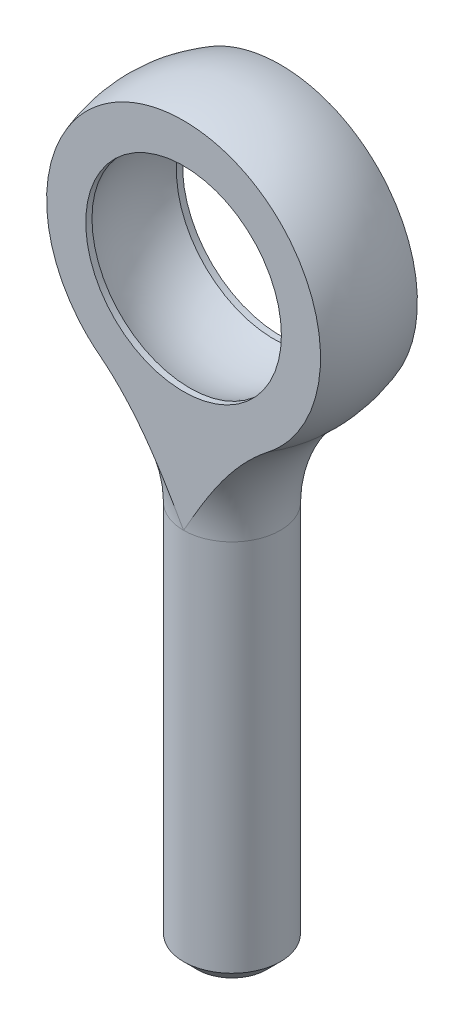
ISO-10303-21;
HEADER;
FILE_DESCRIPTION(('STEP AP214'),'2;1');
FILE_NAME('part.step','',(''),(''),'','','');
FILE_SCHEMA(('AUTOMOTIVE_DESIGN { 1 0 10303 214 1 1 1 1 }'));
ENDSEC;
DATA;
#1=APPLICATION_CONTEXT('core data for automotive mechanical design processes');
#2=APPLICATION_PROTOCOL_DEFINITION('international standard','automotive_design',2000,#1);
#3=PRODUCT_CONTEXT('',#1,'mechanical');
#4=PRODUCT('Part','Part','',(#3));
#5=PRODUCT_RELATED_PRODUCT_CATEGORY('part','',(#4));
#6=PRODUCT_DEFINITION_FORMATION('','',#4);
#7=PRODUCT_DEFINITION_CONTEXT('part definition',#1,'design');
#8=PRODUCT_DEFINITION('design','',#6,#7);
#9=PRODUCT_DEFINITION_SHAPE('','',#8);
#10=(LENGTH_UNIT() NAMED_UNIT(*) SI_UNIT(.MILLI.,.METRE.));
#11=(NAMED_UNIT(*) PLANE_ANGLE_UNIT() SI_UNIT($,.RADIAN.));
#12=(NAMED_UNIT(*) SI_UNIT($,.STERADIAN.) SOLID_ANGLE_UNIT());
#13=UNCERTAINTY_MEASURE_WITH_UNIT(LENGTH_MEASURE(1.E-05),#10,'distance_accuracy_value','');
#14=(GEOMETRIC_REPRESENTATION_CONTEXT(3) GLOBAL_UNCERTAINTY_ASSIGNED_CONTEXT((#13)) GLOBAL_UNIT_ASSIGNED_CONTEXT((#10,
#11,#12)) REPRESENTATION_CONTEXT('',''));
#15=CARTESIAN_POINT('',(0.,0.,0.));
#16=DIRECTION('',(0.,0.,1.));
#17=DIRECTION('',(1.,0.,0.));
#18=AXIS2_PLACEMENT_3D('',#15,#16,#17);
#19=CARTESIAN_POINT('',(0.,14.2875,-3.175));
#20=DIRECTION('',(0.,0.,1.));
#21=DIRECTION('',(1.,0.,0.));
#22=AXIS2_PLACEMENT_3D('',#19,#20,#21);
#23=CYLINDRICAL_SURFACE('',#22,6.4135);
#24=CARTESIAN_POINT('',(0.,14.2875,3.175));
#25=DIRECTION('',(0.,0.,1.));
#26=DIRECTION('',(1.,0.,0.));
#27=AXIS2_PLACEMENT_3D('',#24,#25,#26);
#28=CIRCLE('',#27,6.4135);
#29=CARTESIAN_POINT('',(6.4135,14.2875,3.175));
#30=VERTEX_POINT('',#29);
#31=EDGE_CURVE('E106',#30,#30,#28,.T.);
#32=ORIENTED_EDGE('',*,*,#31,.T.);
#33=EDGE_LOOP('',(#32));
#34=FACE_BOUND('',#33,.T.);
#35=CARTESIAN_POINT('',(0.,14.2875,2.76717233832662));
#36=DIRECTION('',(0.,0.,-1.));
#37=DIRECTION('',(-1.,0.,0.));
#38=AXIS2_PLACEMENT_3D('',#35,#36,#37);
#39=CIRCLE('',#38,6.4135);
#40=CARTESIAN_POINT('',(-6.4135,14.2875,2.76717233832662));
#41=VERTEX_POINT('',#40);
#42=EDGE_CURVE('E38',#41,#41,#39,.F.);
#43=ORIENTED_EDGE('',*,*,#42,.F.);
#44=EDGE_LOOP('',(#43));
#45=FACE_BOUND('',#44,.T.);
#46=ADVANCED_FACE('F34',(#34,#45),#23,.F.);
#47=CARTESIAN_POINT('',(0.,14.2875,-3.175));
#48=DIRECTION('',(0.,0.,1.));
#49=DIRECTION('',(1.,0.,0.));
#50=AXIS2_PLACEMENT_3D('',#47,#48,#49);
#51=CIRCLE('',#50,6.4135);
#52=CARTESIAN_POINT('',(6.4135,14.2875,-3.175));
#53=VERTEX_POINT('',#52);
#54=EDGE_CURVE('E72',#53,#53,#51,.T.);
#55=ORIENTED_EDGE('',*,*,#54,.F.);
#56=EDGE_LOOP('',(#55));
#57=FACE_BOUND('',#56,.T.);
#58=CARTESIAN_POINT('',(0.,14.2875,-2.76717233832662));
#59=DIRECTION('',(0.,0.,1.));
#60=DIRECTION('',(1.,0.,0.));
#61=AXIS2_PLACEMENT_3D('',#58,#59,#60);
#62=CIRCLE('',#61,6.4135);
#63=CARTESIAN_POINT('',(6.4135,14.2875,-2.76717233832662));
#64=VERTEX_POINT('',#63);
#65=EDGE_CURVE('E101',#64,#64,#62,.F.);
#66=ORIENTED_EDGE('',*,*,#65,.F.);
#67=EDGE_LOOP('',(#66));
#68=FACE_BOUND('',#67,.T.);
#69=ADVANCED_FACE('F155',(#57,#68),#23,.F.);
#70=CARTESIAN_POINT('',(0.,0.,0.));
#71=DIRECTION('',(0.,-1.,0.));
#72=DIRECTION('',(1.,0.,0.));
#73=AXIS2_PLACEMENT_3D('',#70,#71,#72);
#74=TOROIDAL_SURFACE('',#73,12.8984375,9.72343750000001);
#75=CARTESIAN_POINT('',(0.,0.,-3.17500000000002));
#76=CARTESIAN_POINT('',(-0.00326153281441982,0.005707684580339,-3.17500000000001));
#77=CARTESIAN_POINT('',(-0.00652306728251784,0.0114153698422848,-3.17500000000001));
#78=CARTESIAN_POINT('',(-0.273129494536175,0.477974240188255,-3.17499999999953));
#79=CARTESIAN_POINT('',(-0.536560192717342,0.938786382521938,-3.17499999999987));
#80=CARTESIAN_POINT('',(-1.07566265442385,1.8532278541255,-3.17500000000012));
#81=CARTESIAN_POINT('',(-1.35133223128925,2.30685844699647,-3.17500000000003));
#82=CARTESIAN_POINT('',(-1.92559609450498,3.19894900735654,-3.17499999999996));
#83=CARTESIAN_POINT('',(-2.22416629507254,3.63742422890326,-3.17499999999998));
#84=CARTESIAN_POINT('',(-2.85309895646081,4.49102276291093,-3.175));
#85=CARTESIAN_POINT('',(-3.18344395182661,4.90615870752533,-3.17499999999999));
#86=CARTESIAN_POINT('',(-3.77466960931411,5.58162755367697,-3.17499999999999));
#87=CARTESIAN_POINT('',(-4.02585009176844,5.85044049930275,-3.17499999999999));
#88=CARTESIAN_POINT('',(-4.54711374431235,6.36901465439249,-3.17499999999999));
#89=CARTESIAN_POINT('',(-4.8171908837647,6.61878188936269,-3.17499999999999));
#90=CARTESIAN_POINT('',(-5.37662445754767,7.09612768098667,-3.17499999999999));
#91=CARTESIAN_POINT('',(-5.66599147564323,7.32369388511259,-3.17499999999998));
#92=CARTESIAN_POINT('',(-6.26322715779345,7.75319037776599,-3.17499999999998));
#93=CARTESIAN_POINT('',(-6.57109562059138,7.95512094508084,-3.17499999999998));
#94=CARTESIAN_POINT('',(-7.20718830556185,8.33213779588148,-3.17499999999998));
#95=CARTESIAN_POINT('',(-7.5355887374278,8.50692791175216,-3.17499999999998));
#96=CARTESIAN_POINT('',(-8.20771747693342,8.8241919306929,-3.17499999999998));
#97=CARTESIAN_POINT('',(-8.55144656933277,8.96666417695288,-3.17499999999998));
#98=CARTESIAN_POINT('',(-9.25110720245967,9.21656726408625,-3.17499999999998));
#99=CARTESIAN_POINT('',(-9.60702765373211,9.32402906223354,-3.17499999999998));
#100=CARTESIAN_POINT('',(-10.3280020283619,9.50191139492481,-3.17499999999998));
#101=CARTESIAN_POINT('',(-10.6930544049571,9.57233815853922,-3.17499999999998));
#102=CARTESIAN_POINT('',(-11.3741481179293,9.66696888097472,-3.17499999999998));
#103=CARTESIAN_POINT('',(-11.6894621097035,9.69646466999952,-3.17499999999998));
#104=CARTESIAN_POINT('',(-12.3214131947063,9.72667494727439,-3.17499999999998));
#105=CARTESIAN_POINT('',(-12.6380499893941,9.72739561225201,-3.17499999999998));
#106=CARTESIAN_POINT('',(-13.2714560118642,9.69958458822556,-3.17499999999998));
#107=CARTESIAN_POINT('',(-13.5882199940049,9.67092754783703,-3.17499999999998));
#108=CARTESIAN_POINT('',(-14.0603016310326,9.60580647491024,-3.17499999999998));
#109=CARTESIAN_POINT('',(-14.2172131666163,9.58039570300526,-3.17499999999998));
#110=CARTESIAN_POINT('',(-14.5296709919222,9.5222100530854,-3.17499999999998));
#111=CARTESIAN_POINT('',(-14.6852172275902,9.48943488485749,-3.17499999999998));
#112=CARTESIAN_POINT('',(-14.8399244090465,9.45298870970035,-3.17499999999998));
#113=B_SPLINE_CURVE_WITH_KNOTS('',3,(#75,#76,#77,#78,#79,#80,#81,#82,#83,#84,#85,#86,#87,#88,
#89,#90,#91,#92,#93,#94,#95,#96,#97,#98,#99,#100,#101,#102,#103,#104,#105,#106,#107,#108,#109,
#110,#111,#112),.UNSPECIFIED.,.F.,.F.,(4,2,2,2,2,2,2,2,2,2,2,2,2,2,2,2,2,2,4),(0.,
0.0197214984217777,1.6120807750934,3.20415668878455,4.79458050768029,6.38413507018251,
7.48699761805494,8.58950979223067,9.692631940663,10.7957420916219,11.9101519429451,
13.0246189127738,14.1380977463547,15.2513892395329,16.2001992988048,17.1488056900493,
18.1014765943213,18.5781908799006,19.0549239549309),.UNSPECIFIED.);
#114=CARTESIAN_POINT('',(0.,0.,-3.175));
#115=VERTEX_POINT('',#114);
#116=CARTESIAN_POINT('',(-5.53702467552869,7.21739690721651,-3.17499999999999));
#117=VERTEX_POINT('',#116);
#118=EDGE_CURVE('E50',#115,#117,#113,.T.);
#119=ORIENTED_EDGE('',*,*,#118,.F.);
#120=CARTESIAN_POINT('',(0.,0.,0.));
#121=DIRECTION('',(0.,1.,0.));
#122=DIRECTION('',(-1.,0.,0.));
#123=AXIS2_PLACEMENT_3D('',#120,#121,#122);
#124=CIRCLE('',#123,3.175);
#125=CARTESIAN_POINT('',(0.,0.,3.175));
#126=VERTEX_POINT('',#125);
#127=EDGE_CURVE('E79',#115,#126,#124,.T.);
#128=ORIENTED_EDGE('',*,*,#127,.T.);
#129=CARTESIAN_POINT('',(0.,0.,3.17500000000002));
#130=CARTESIAN_POINT('',(-0.00326153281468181,0.00570768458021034,3.17500000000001));
#131=CARTESIAN_POINT('',(-0.00652306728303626,0.0114153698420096,3.175));
#132=CARTESIAN_POINT('',(-0.273129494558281,0.477974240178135,3.17499999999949));
#133=CARTESIAN_POINT('',(-0.536560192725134,0.938786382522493,3.17499999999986));
#134=CARTESIAN_POINT('',(-1.07566265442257,1.853227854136,3.17500000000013));
#135=CARTESIAN_POINT('',(-1.35133223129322,2.30685844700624,3.17500000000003));
#136=CARTESIAN_POINT('',(-1.92559609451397,3.19894900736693,3.17499999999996));
#137=CARTESIAN_POINT('',(-2.22416629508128,3.63742422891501,3.17499999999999));
#138=CARTESIAN_POINT('',(-2.85309895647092,4.49102276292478,3.17500000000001));
#139=CARTESIAN_POINT('',(-3.18344395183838,4.90615870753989,3.175));
#140=CARTESIAN_POINT('',(-3.77466960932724,5.58162755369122,3.175));
#141=CARTESIAN_POINT('',(-4.02585009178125,5.85044049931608,3.175));
#142=CARTESIAN_POINT('',(-4.54711374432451,6.36901465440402,3.175));
#143=CARTESIAN_POINT('',(-4.81719088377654,6.61878188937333,3.175));
#144=CARTESIAN_POINT('',(-5.37662445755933,7.0961276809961,3.175));
#145=CARTESIAN_POINT('',(-5.66599147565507,7.32369388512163,3.175));
#146=CARTESIAN_POINT('',(-6.26322715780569,7.75319037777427,3.175));
#147=CARTESIAN_POINT('',(-6.57109562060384,7.95512094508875,3.175));
#148=CARTESIAN_POINT('',(-7.20718830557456,8.33213779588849,3.175));
#149=CARTESIAN_POINT('',(-7.53558873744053,8.50692791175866,3.175));
#150=CARTESIAN_POINT('',(-8.2077174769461,8.82419193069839,3.175));
#151=CARTESIAN_POINT('',(-8.5514465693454,8.96666417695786,3.175));
#152=CARTESIAN_POINT('',(-9.25110720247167,9.21656726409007,3.175));
#153=CARTESIAN_POINT('',(-9.60702765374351,9.32402906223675,3.175));
#154=CARTESIAN_POINT('',(-10.328002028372,9.50191139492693,3.175));
#155=CARTESIAN_POINT('',(-10.6930544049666,9.57233815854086,3.175));
#156=CARTESIAN_POINT('',(-11.3741481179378,9.66696888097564,3.175));
#157=CARTESIAN_POINT('',(-11.6894621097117,9.69646467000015,3.175));
#158=CARTESIAN_POINT('',(-12.3214131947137,9.72667494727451,3.175));
#159=CARTESIAN_POINT('',(-12.6380499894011,9.72739561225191,3.175));
#160=CARTESIAN_POINT('',(-13.2714560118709,9.69958458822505,3.175));
#161=CARTESIAN_POINT('',(-13.5882199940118,9.67092754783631,3.175));
#162=CARTESIAN_POINT('',(-14.0603016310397,9.60580647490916,3.175));
#163=CARTESIAN_POINT('',(-14.2172131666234,9.58039570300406,3.175));
#164=CARTESIAN_POINT('',(-14.5296709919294,9.52221005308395,3.175));
#165=CARTESIAN_POINT('',(-14.6852172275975,9.48943488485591,3.175));
#166=CARTESIAN_POINT('',(-14.8399244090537,9.45298870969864,3.175));
#167=B_SPLINE_CURVE_WITH_KNOTS('',3,(#129,#130,#131,#132,#133,#134,#135,#136,#137,#138,#139,
#140,#141,#142,#143,#144,#145,#146,#147,#148,#149,#150,#151,#152,#153,#154,#155,#156,#157,#158,
#159,#160,#161,#162,#163,#164,#165,#166),.UNSPECIFIED.,.F.,.F.,(4,2,2,2,2,2,2,2,2,2,2,2,2,2,2,2,
2,2,4),(0.,0.0197214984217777,1.61208077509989,3.20415668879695,4.79458050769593,
6.38413507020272,7.48699761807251,8.58950979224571,9.69263194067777,10.7957420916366,
11.9101519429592,13.0246189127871,14.1380977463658,15.2513892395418,16.2001992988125,
17.1488056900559,18.1014765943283,18.5781908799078,19.0549239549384),.UNSPECIFIED.);
#168=CARTESIAN_POINT('',(-5.53702467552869,7.21739690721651,3.175));
#169=VERTEX_POINT('',#168);
#170=EDGE_CURVE('E83',#169,#126,#167,.F.);
#171=ORIENTED_EDGE('',*,*,#170,.F.);
#172=CARTESIAN_POINT('',(0.,7.21739690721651,0.));
#173=DIRECTION('',(0.,-1.,0.));
#174=DIRECTION('',(1.,0.,0.));
#175=AXIS2_PLACEMENT_3D('',#172,#173,#174);
#176=CIRCLE('',#175,6.38273195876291);
#177=EDGE_CURVE('E82',#169,#117,#176,.T.);
#178=ORIENTED_EDGE('',*,*,#177,.T.);
#179=EDGE_LOOP('',(#119,#128,#171,#178));
#180=FACE_BOUND('',#179,.T.);
#181=ADVANCED_FACE('F77',(#180),#74,.F.);
#182=CARTESIAN_POINT('',(0.,-25.4,0.));
#183=DIRECTION('',(0.,1.,0.));
#184=DIRECTION('',(-1.,0.,0.));
#185=AXIS2_PLACEMENT_3D('',#182,#183,#184);
#186=PLANE('',#185);
#187=CARTESIAN_POINT('',(0.,-25.4,0.));
#188=DIRECTION('',(0.,1.,0.));
#189=DIRECTION('',(-1.,0.,0.));
#190=AXIS2_PLACEMENT_3D('',#187,#188,#189);
#191=CIRCLE('',#190,2.26822);
#192=CARTESIAN_POINT('',(-2.26822,-25.4,0.));
#193=VERTEX_POINT('',#192);
#194=EDGE_CURVE('E94',#193,#193,#191,.F.);
#195=ORIENTED_EDGE('',*,*,#194,.T.);
#196=EDGE_LOOP('',(#195));
#197=FACE_BOUND('',#196,.T.);
#198=ADVANCED_FACE('F191',(#197),#186,.F.);
#199=CARTESIAN_POINT('',(0.,23.8125,0.));
#200=DIRECTION('',(0.,1.,0.));
#201=DIRECTION('',(-1.,0.,0.));
#202=AXIS2_PLACEMENT_3D('',#199,#200,#201);
#203=CYLINDRICAL_SURFACE('',#202,3.175);
#204=CARTESIAN_POINT('',(0.,-24.49322,0.));
#205=DIRECTION('',(0.,1.,0.));
#206=DIRECTION('',(-1.,0.,0.));
#207=AXIS2_PLACEMENT_3D('',#204,#205,#206);
#208=CIRCLE('',#207,3.175);
#209=CARTESIAN_POINT('',(-3.175,-24.49322,0.));
#210=VERTEX_POINT('',#209);
#211=EDGE_CURVE('E92',#210,#210,#208,.T.);
#212=ORIENTED_EDGE('',*,*,#211,.T.);
#213=EDGE_LOOP('',(#212));
#214=FACE_BOUND('',#213,.T.);
#215=EDGE_CURVE('E88',#126,#115,#124,.T.);
#216=ORIENTED_EDGE('',*,*,#215,.F.);
#217=ORIENTED_EDGE('',*,*,#127,.F.);
#218=EDGE_LOOP('',(#216,#217));
#219=FACE_BOUND('',#218,.T.);
#220=ADVANCED_FACE('F87',(#214,#219),#203,.T.);
#221=CARTESIAN_POINT('',(0.,-24.49322,0.));
#222=DIRECTION('',(0.,1.,0.));
#223=DIRECTION('',(-1.,0.,0.));
#224=AXIS2_PLACEMENT_3D('',#221,#222,#223);
#225=CONICAL_SURFACE('',#224,3.175,0.785398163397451);
#226=ORIENTED_EDGE('',*,*,#194,.F.);
#227=EDGE_LOOP('',(#226));
#228=FACE_BOUND('',#227,.T.);
#229=ORIENTED_EDGE('',*,*,#211,.F.);
#230=EDGE_LOOP('',(#229));
#231=FACE_BOUND('',#230,.T.);
#232=ADVANCED_FACE('F36',(#228,#231),#225,.T.);
#233=CARTESIAN_POINT('',(0.,0.,-3.17500000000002));
#234=CARTESIAN_POINT('',(0.00326153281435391,0.005707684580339,-3.17500000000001));
#235=CARTESIAN_POINT('',(0.00652306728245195,0.0114153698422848,-3.17500000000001));
#236=CARTESIAN_POINT('',(0.273129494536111,0.477974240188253,-3.17499999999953));
#237=CARTESIAN_POINT('',(0.536560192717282,0.938786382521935,-3.17499999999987));
#238=CARTESIAN_POINT('',(1.07566265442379,1.8532278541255,-3.17500000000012));
#239=CARTESIAN_POINT('',(1.35133223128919,2.30685844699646,-3.17500000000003));
#240=CARTESIAN_POINT('',(1.92559609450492,3.19894900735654,-3.17499999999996));
#241=CARTESIAN_POINT('',(2.22416629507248,3.63742422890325,-3.17499999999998));
#242=CARTESIAN_POINT('',(2.85309895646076,4.49102276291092,-3.175));
#243=CARTESIAN_POINT('',(3.18344395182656,4.90615870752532,-3.17499999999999));
#244=CARTESIAN_POINT('',(3.77466960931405,5.58162755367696,-3.17499999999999));
#245=CARTESIAN_POINT('',(4.02585009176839,5.85044049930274,-3.17499999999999));
#246=CARTESIAN_POINT('',(4.54711374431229,6.36901465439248,-3.17499999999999));
#247=CARTESIAN_POINT('',(4.81719088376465,6.61878188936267,-3.17499999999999));
#248=CARTESIAN_POINT('',(5.37662445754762,7.09612768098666,-3.17499999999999));
#249=CARTESIAN_POINT('',(5.66599147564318,7.32369388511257,-3.17499999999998));
#250=CARTESIAN_POINT('',(6.2632271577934,7.75319037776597,-3.17499999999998));
#251=CARTESIAN_POINT('',(6.57109562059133,7.95512094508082,-3.17499999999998));
#252=CARTESIAN_POINT('',(7.2071883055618,8.33213779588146,-3.17499999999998));
#253=CARTESIAN_POINT('',(7.53558873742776,8.50692791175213,-3.17499999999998));
#254=CARTESIAN_POINT('',(8.20771747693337,8.82419193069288,-3.17499999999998));
#255=CARTESIAN_POINT('',(8.55144656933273,8.96666417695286,-3.17499999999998));
#256=CARTESIAN_POINT('',(9.25110720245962,9.21656726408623,-3.17499999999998));
#257=CARTESIAN_POINT('',(9.60702765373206,9.32402906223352,-3.17499999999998));
#258=CARTESIAN_POINT('',(10.3280020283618,9.50191139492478,-3.17499999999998));
#259=CARTESIAN_POINT('',(10.6930544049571,9.57233815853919,-3.17499999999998));
#260=CARTESIAN_POINT('',(11.3741481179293,9.6669688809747,-3.17499999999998));
#261=CARTESIAN_POINT('',(11.6894621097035,9.69646466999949,-3.17499999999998));
#262=CARTESIAN_POINT('',(12.3214131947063,9.72667494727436,-3.17499999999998));
#263=CARTESIAN_POINT('',(12.638049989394,9.72739561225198,-3.17499999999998));
#264=CARTESIAN_POINT('',(13.2714560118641,9.69958458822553,-3.17499999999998));
#265=CARTESIAN_POINT('',(13.5882199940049,9.670927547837,-3.17499999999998));
#266=CARTESIAN_POINT('',(14.0603016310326,9.60580647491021,-3.17499999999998));
#267=CARTESIAN_POINT('',(14.2172131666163,9.58039570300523,-3.17499999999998));
#268=CARTESIAN_POINT('',(14.5296709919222,9.52221005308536,-3.17499999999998));
#269=CARTESIAN_POINT('',(14.6852172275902,9.48943488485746,-3.17499999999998));
#270=CARTESIAN_POINT('',(14.8399244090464,9.45298870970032,-3.17499999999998));
#271=B_SPLINE_CURVE_WITH_KNOTS('',3,(#233,#234,#235,#236,#237,#238,#239,#240,#241,#242,#243,
#244,#245,#246,#247,#248,#249,#250,#251,#252,#253,#254,#255,#256,#257,#258,#259,#260,#261,#262,
#263,#264,#265,#266,#267,#268,#269,#270),.UNSPECIFIED.,.F.,.F.,(4,2,2,2,2,2,2,2,2,2,2,2,2,2,2,2,
2,2,4),(0.,0.0197214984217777,1.6120807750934,3.20415668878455,4.79458050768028,
6.38413507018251,7.48699761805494,8.58950979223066,9.692631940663,10.7957420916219,
11.9101519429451,13.0246189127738,14.1380977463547,15.2513892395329,16.2001992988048,
17.1488056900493,18.1014765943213,18.5781908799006,19.0549239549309),.UNSPECIFIED.);
#272=CARTESIAN_POINT('',(5.53702467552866,7.2173969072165,-3.17499999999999));
#273=VERTEX_POINT('',#272);
#274=EDGE_CURVE('E69',#273,#115,#271,.F.);
#275=ORIENTED_EDGE('',*,*,#274,.F.);
#276=CARTESIAN_POINT('',(5.53702467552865,7.2173969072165,3.175));
#277=VERTEX_POINT('',#276);
#278=EDGE_CURVE('E58',#273,#277,#176,.T.);
#279=ORIENTED_EDGE('',*,*,#278,.T.);
#280=CARTESIAN_POINT('',(0.,0.,3.17500000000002));
#281=CARTESIAN_POINT('',(0.0032615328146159,0.00570768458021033,3.17500000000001));
#282=CARTESIAN_POINT('',(0.00652306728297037,0.0114153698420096,3.175));
#283=CARTESIAN_POINT('',(0.273129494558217,0.477974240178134,3.17499999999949));
#284=CARTESIAN_POINT('',(0.536560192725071,0.938786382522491,3.17499999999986));
#285=CARTESIAN_POINT('',(1.07566265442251,1.853227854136,3.17500000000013));
#286=CARTESIAN_POINT('',(1.35133223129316,2.30685844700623,3.17500000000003));
#287=CARTESIAN_POINT('',(1.92559609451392,3.19894900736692,3.17499999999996));
#288=CARTESIAN_POINT('',(2.22416629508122,3.637424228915,3.17499999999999));
#289=CARTESIAN_POINT('',(2.85309895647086,4.49102276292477,3.17500000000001));
#290=CARTESIAN_POINT('',(3.18344395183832,4.90615870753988,3.175));
#291=CARTESIAN_POINT('',(3.77466960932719,5.58162755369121,3.175));
#292=CARTESIAN_POINT('',(4.0258500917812,5.85044049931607,3.175));
#293=CARTESIAN_POINT('',(4.54711374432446,6.36901465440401,3.175));
#294=CARTESIAN_POINT('',(4.81719088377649,6.61878188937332,3.175));
#295=CARTESIAN_POINT('',(5.37662445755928,7.09612768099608,3.175));
#296=CARTESIAN_POINT('',(5.66599147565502,7.32369388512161,3.175));
#297=CARTESIAN_POINT('',(6.26322715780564,7.75319037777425,3.175));
#298=CARTESIAN_POINT('',(6.57109562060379,7.95512094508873,3.175));
#299=CARTESIAN_POINT('',(7.20718830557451,8.33213779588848,3.175));
#300=CARTESIAN_POINT('',(7.53558873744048,8.50692791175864,3.175));
#301=CARTESIAN_POINT('',(8.20771747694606,8.82419193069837,3.175));
#302=CARTESIAN_POINT('',(8.55144656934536,8.96666417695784,3.175));
#303=CARTESIAN_POINT('',(9.25110720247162,9.21656726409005,3.175));
#304=CARTESIAN_POINT('',(9.60702765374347,9.32402906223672,3.175));
#305=CARTESIAN_POINT('',(10.328002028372,9.5019113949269,3.175));
#306=CARTESIAN_POINT('',(10.6930544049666,9.57233815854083,3.175));
#307=CARTESIAN_POINT('',(11.3741481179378,9.66696888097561,3.175));
#308=CARTESIAN_POINT('',(11.6894621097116,9.69646467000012,3.175));
#309=CARTESIAN_POINT('',(12.3214131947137,9.72667494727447,3.175));
#310=CARTESIAN_POINT('',(12.638049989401,9.72739561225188,3.175));
#311=CARTESIAN_POINT('',(13.2714560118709,9.69958458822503,3.175));
#312=CARTESIAN_POINT('',(13.5882199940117,9.67092754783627,3.175));
#313=CARTESIAN_POINT('',(14.0603016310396,9.60580647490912,3.175));
#314=CARTESIAN_POINT('',(14.2172131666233,9.58039570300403,3.175));
#315=CARTESIAN_POINT('',(14.5296709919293,9.52221005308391,3.175));
#316=CARTESIAN_POINT('',(14.6852172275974,9.48943488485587,3.175));
#317=CARTESIAN_POINT('',(14.8399244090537,9.45298870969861,3.175));
#318=B_SPLINE_CURVE_WITH_KNOTS('',3,(#280,#281,#282,#283,#284,#285,#286,#287,#288,#289,#290,
#291,#292,#293,#294,#295,#296,#297,#298,#299,#300,#301,#302,#303,#304,#305,#306,#307,#308,#309,
#310,#311,#312,#313,#314,#315,#316,#317),.UNSPECIFIED.,.F.,.F.,(4,2,2,2,2,2,2,2,2,2,2,2,2,2,2,2,
2,2,4),(0.,0.0197214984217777,1.61208077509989,3.20415668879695,4.79458050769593,
6.38413507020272,7.48699761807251,8.58950979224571,9.69263194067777,10.7957420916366,
11.9101519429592,13.0246189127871,14.1380977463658,15.2513892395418,16.2001992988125,
17.1488056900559,18.1014765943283,18.5781908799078,19.0549239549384),.UNSPECIFIED.);
#319=EDGE_CURVE('E91',#126,#277,#318,.T.);
#320=ORIENTED_EDGE('',*,*,#319,.F.);
#321=ORIENTED_EDGE('',*,*,#215,.T.);
#322=EDGE_LOOP('',(#275,#279,#320,#321));
#323=FACE_BOUND('',#322,.T.);
#324=ADVANCED_FACE('F90',(#323),#74,.F.);
#325=CARTESIAN_POINT('',(0.,14.2875,0.));
#326=DIRECTION('',(0.,-1.,0.));
#327=DIRECTION('',(1.,0.,0.));
#328=AXIS2_PLACEMENT_3D('',#325,#326,#327);
#329=SPHERICAL_SURFACE('',#328,9.525);
#330=CARTESIAN_POINT('',(0.,14.2875,-3.17499999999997));
#331=DIRECTION('',(0.,0.,1.));
#332=DIRECTION('',(0.,-1.,0.));
#333=AXIS2_PLACEMENT_3D('',#330,#331,#332);
#334=CIRCLE('',#333,8.98025612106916);
#335=EDGE_CURVE('E11',#117,#273,#334,.F.);
#336=ORIENTED_EDGE('',*,*,#335,.F.);
#337=ORIENTED_EDGE('',*,*,#177,.F.);
#338=CARTESIAN_POINT('',(0.,14.2875,3.175));
#339=DIRECTION('',(0.,0.,-1.));
#340=DIRECTION('',(0.,1.,0.));
#341=AXIS2_PLACEMENT_3D('',#338,#339,#340);
#342=CIRCLE('',#341,8.98025612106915);
#343=EDGE_CURVE('E43',#277,#169,#342,.F.);
#344=ORIENTED_EDGE('',*,*,#343,.F.);
#345=ORIENTED_EDGE('',*,*,#278,.F.);
#346=EDGE_LOOP('',(#336,#337,#344,#345));
#347=FACE_BOUND('',#346,.T.);
#348=ADVANCED_FACE('F131',(#347),#329,.T.);
#349=CARTESIAN_POINT('',(-9.525,23.8125,3.175));
#350=DIRECTION('',(0.,0.,-1.));
#351=DIRECTION('',(0.,1.,0.));
#352=AXIS2_PLACEMENT_3D('',#349,#350,#351);
#353=PLANE('',#352);
#354=ORIENTED_EDGE('',*,*,#31,.F.);
#355=EDGE_LOOP('',(#354));
#356=FACE_BOUND('',#355,.T.);
#357=ORIENTED_EDGE('',*,*,#319,.T.);
#358=ORIENTED_EDGE('',*,*,#343,.T.);
#359=ORIENTED_EDGE('',*,*,#170,.T.);
#360=EDGE_LOOP('',(#357,#358,#359));
#361=FACE_BOUND('',#360,.T.);
#362=ADVANCED_FACE('F141',(#356,#361),#353,.F.);
#363=CARTESIAN_POINT('',(-9.525,0.,-3.175));
#364=DIRECTION('',(0.,0.,1.));
#365=DIRECTION('',(0.,-1.,0.));
#366=AXIS2_PLACEMENT_3D('',#363,#364,#365);
#367=PLANE('',#366);
#368=ORIENTED_EDGE('',*,*,#54,.T.);
#369=EDGE_LOOP('',(#368));
#370=FACE_BOUND('',#369,.T.);
#371=ORIENTED_EDGE('',*,*,#118,.T.);
#372=ORIENTED_EDGE('',*,*,#335,.T.);
#373=ORIENTED_EDGE('',*,*,#274,.T.);
#374=EDGE_LOOP('',(#371,#372,#373));
#375=FACE_BOUND('',#374,.T.);
#376=ADVANCED_FACE('F70',(#370,#375),#367,.F.);
#377=CARTESIAN_POINT('',(0.,14.2875,0.));
#378=DIRECTION('',(0.,1.,0.));
#379=DIRECTION('',(1.,0.,0.));
#380=AXIS2_PLACEMENT_3D('',#377,#378,#379);
#381=SPHERICAL_SURFACE('',#380,6.985);
#382=CARTESIAN_POINT('',(0.,14.2875,0.));
#383=DIRECTION('',(0.,0.,1.));
#384=DIRECTION('',(1.,0.,0.));
#385=AXIS2_PLACEMENT_3D('',#382,#383,#384);
#386=SPHERICAL_SURFACE('',#385,6.985);
#387=ORIENTED_EDGE('',*,*,#65,.T.);
#388=EDGE_LOOP('',(#387));
#389=FACE_BOUND('',#388,.T.);
#390=ORIENTED_EDGE('',*,*,#42,.T.);
#391=EDGE_LOOP('',(#390));
#392=FACE_BOUND('',#391,.T.);
#393=ADVANCED_FACE('F150',(#389,#392),#386,.F.);
#394=CLOSED_SHELL('',(#46,#69,#181,#198,#220,#232,#324,#348,#362,#376,#393));
#395=MANIFOLD_SOLID_BREP('B2',#394);
#396=ADVANCED_BREP_SHAPE_REPRESENTATION('',(#18,#395),#14);
#397=SHAPE_DEFINITION_REPRESENTATION(#9,#396);
ENDSEC;
END-ISO-10303-21;
